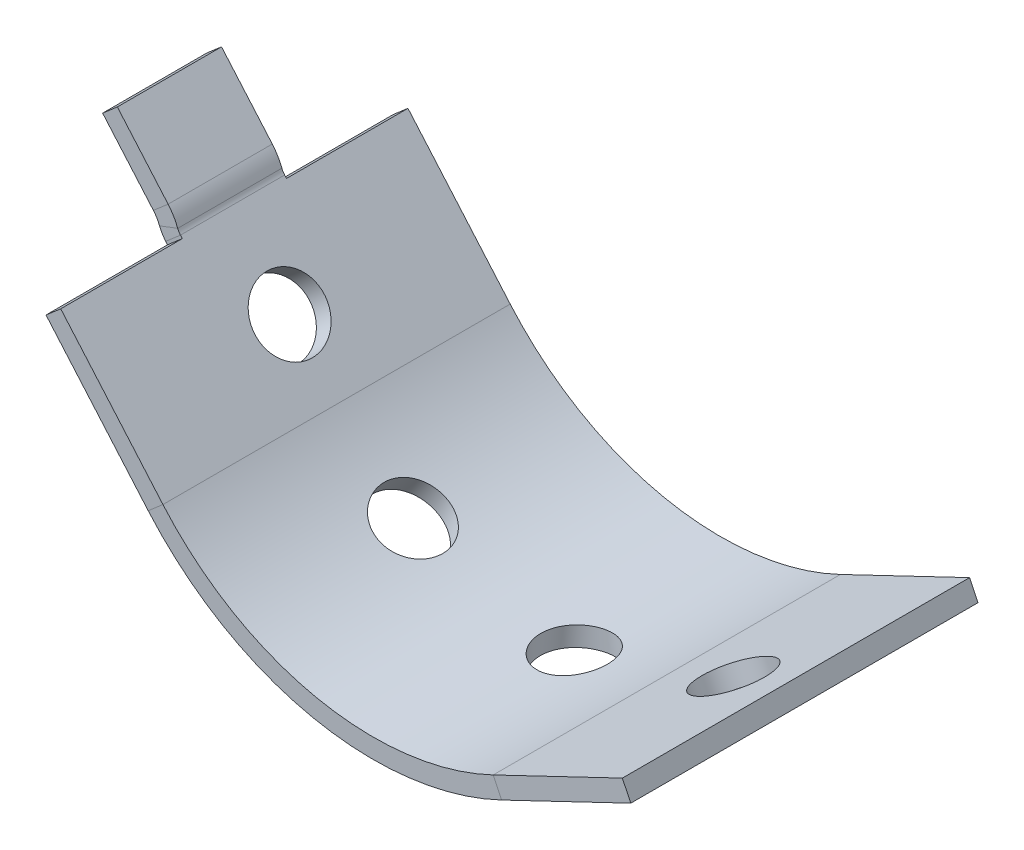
ISO-10303-21;
HEADER;
FILE_DESCRIPTION(('STEP AP214'),'2;1');
FILE_NAME('part.step','',(''),(''),'','','');
FILE_SCHEMA(('AUTOMOTIVE_DESIGN { 1 0 10303 214 1 1 1 1 }'));
ENDSEC;
DATA;
#1=APPLICATION_CONTEXT('core data for automotive mechanical design processes');
#2=APPLICATION_PROTOCOL_DEFINITION('international standard','automotive_design',2000,#1);
#3=PRODUCT_CONTEXT('',#1,'mechanical');
#4=PRODUCT('Part','Part','',(#3));
#5=PRODUCT_RELATED_PRODUCT_CATEGORY('part','',(#4));
#6=PRODUCT_DEFINITION_FORMATION('','',#4);
#7=PRODUCT_DEFINITION_CONTEXT('part definition',#1,'design');
#8=PRODUCT_DEFINITION('design','',#6,#7);
#9=PRODUCT_DEFINITION_SHAPE('','',#8);
#10=(LENGTH_UNIT() NAMED_UNIT(*) SI_UNIT(.MILLI.,.METRE.));
#11=(NAMED_UNIT(*) PLANE_ANGLE_UNIT() SI_UNIT($,.RADIAN.));
#12=(NAMED_UNIT(*) SI_UNIT($,.STERADIAN.) SOLID_ANGLE_UNIT());
#13=UNCERTAINTY_MEASURE_WITH_UNIT(LENGTH_MEASURE(1.E-05),#10,'distance_accuracy_value','');
#14=(GEOMETRIC_REPRESENTATION_CONTEXT(3) GLOBAL_UNCERTAINTY_ASSIGNED_CONTEXT((#13)) GLOBAL_UNIT_ASSIGNED_CONTEXT((#10,
#11,#12)) REPRESENTATION_CONTEXT('',''));
#15=CARTESIAN_POINT('',(0.,0.,0.));
#16=DIRECTION('',(0.,0.,1.));
#17=DIRECTION('',(1.,0.,0.));
#18=AXIS2_PLACEMENT_3D('',#15,#16,#17);
#19=CARTESIAN_POINT('',(89.0197499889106,-373.844889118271,7.5));
#20=DIRECTION('',(0.653423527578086,-0.756992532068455,0.));
#21=DIRECTION('',(0.756992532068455,0.653423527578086,0.));
#22=AXIS2_PLACEMENT_3D('',#19,#20,#21);
#23=PLANE('',#22);
#24=DIRECTION('',(0.756992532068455,0.653423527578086,0.));
#25=VECTOR('',#24,1.);
#26=CARTESIAN_POINT('',(89.0197499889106,-373.844889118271,7.5));
#27=LINE('',#26,#25);
#28=CARTESIAN_POINT('',(115.231401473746,-351.219421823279,7.5));
#29=VERTEX_POINT('',#28);
#30=CARTESIAN_POINT('',(117.350980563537,-349.38983594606,7.5));
#31=VERTEX_POINT('',#30);
#32=EDGE_CURVE('E443',#29,#31,#27,.T.);
#33=ORIENTED_EDGE('',*,*,#32,.T.);
#34=DIRECTION('',(0.,0.,-1.));
#35=VECTOR('',#34,1.);
#36=CARTESIAN_POINT('',(117.350980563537,-349.38983594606,7.5));
#37=LINE('',#36,#35);
#38=CARTESIAN_POINT('',(117.350980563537,-349.38983594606,-7.5));
#39=VERTEX_POINT('',#38);
#40=EDGE_CURVE('E441',#31,#39,#37,.T.);
#41=ORIENTED_EDGE('',*,*,#40,.T.);
#42=DIRECTION('',(0.756992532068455,0.653423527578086,0.));
#43=VECTOR('',#42,1.);
#44=CARTESIAN_POINT('',(89.0197499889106,-373.844889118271,-7.5));
#45=LINE('',#44,#43);
#46=CARTESIAN_POINT('',(115.231401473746,-351.219421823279,-7.5));
#47=VERTEX_POINT('',#46);
#48=EDGE_CURVE('E73',#47,#39,#45,.T.);
#49=ORIENTED_EDGE('',*,*,#48,.F.);
#50=DIRECTION('',(0.,0.,-1.));
#51=VECTOR('',#50,1.);
#52=CARTESIAN_POINT('',(115.231401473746,-351.219421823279,7.5));
#53=LINE('',#52,#51);
#54=EDGE_CURVE('E11',#29,#47,#53,.T.);
#55=ORIENTED_EDGE('',*,*,#54,.F.);
#56=EDGE_LOOP('',(#33,#41,#49,#55));
#57=FACE_BOUND('',#56,.T.);
#58=ADVANCED_FACE('F35',(#57),#23,.F.);
#59=CARTESIAN_POINT('',(96.3304194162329,-382.314315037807,7.5));
#60=DIRECTION('',(0.,0.,-1.));
#61=DIRECTION('',(-1.,0.,0.));
#62=AXIS2_PLACEMENT_3D('',#59,#60,#61);
#63=PLANE('',#62);
#64=DIRECTION('',(0.756992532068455,0.653423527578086,0.));
#65=VECTOR('',#64,1.);
#66=CARTESIAN_POINT('',(96.3304194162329,-382.314315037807,7.5));
#67=LINE('',#66,#65);
#68=CARTESIAN_POINT('',(122.542070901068,-359.688847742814,7.50000000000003));
#69=VERTEX_POINT('',#68);
#70=CARTESIAN_POINT('',(124.66164999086,-357.859261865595,7.50000000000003));
#71=VERTEX_POINT('',#70);
#72=EDGE_CURVE('E438',#69,#71,#67,.T.);
#73=ORIENTED_EDGE('',*,*,#72,.T.);
#74=DIRECTION('',(-0.653423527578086,0.756992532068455,0.));
#75=VECTOR('',#74,1.);
#76=CARTESIAN_POINT('',(124.66164999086,-357.859261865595,7.5));
#77=LINE('',#76,#75);
#78=EDGE_CURVE('E435',#71,#31,#77,.T.);
#79=ORIENTED_EDGE('',*,*,#78,.T.);
#80=ORIENTED_EDGE('',*,*,#32,.F.);
#81=DIRECTION('',(-0.653423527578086,0.756992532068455,0.));
#82=VECTOR('',#81,1.);
#83=CARTESIAN_POINT('',(122.542070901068,-359.688847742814,7.5));
#84=LINE('',#83,#82);
#85=EDGE_CURVE('E45',#69,#29,#84,.T.);
#86=ORIENTED_EDGE('',*,*,#85,.F.);
#87=EDGE_LOOP('',(#73,#79,#80,#86));
#88=FACE_BOUND('',#87,.T.);
#89=ADVANCED_FACE('F459',(#88),#63,.F.);
#90=CARTESIAN_POINT('',(124.66164999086,-357.859261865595,7.5));
#91=DIRECTION('',(-0.756992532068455,-0.653423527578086,0.));
#92=DIRECTION('',(0.653423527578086,-0.756992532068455,0.));
#93=AXIS2_PLACEMENT_3D('',#90,#91,#92);
#94=PLANE('',#93);
#95=DIRECTION('',(-0.653423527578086,0.756992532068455,0.));
#96=VECTOR('',#95,1.);
#97=CARTESIAN_POINT('',(124.66164999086,-357.859261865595,-7.5));
#98=LINE('',#97,#96);
#99=CARTESIAN_POINT('',(124.66164999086,-357.859261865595,-7.5));
#100=VERTEX_POINT('',#99);
#101=EDGE_CURVE('E433',#100,#39,#98,.T.);
#102=ORIENTED_EDGE('',*,*,#101,.T.);
#103=ORIENTED_EDGE('',*,*,#40,.F.);
#104=ORIENTED_EDGE('',*,*,#78,.F.);
#105=DIRECTION('',(0.,0.,-1.));
#106=VECTOR('',#105,1.);
#107=CARTESIAN_POINT('',(124.66164999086,-357.859261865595,7.5));
#108=LINE('',#107,#106);
#109=EDGE_CURVE('E196',#71,#100,#108,.T.);
#110=ORIENTED_EDGE('',*,*,#109,.T.);
#111=EDGE_LOOP('',(#102,#103,#104,#110));
#112=FACE_BOUND('',#111,.T.);
#113=ADVANCED_FACE('F461',(#112),#94,.F.);
#114=CARTESIAN_POINT('',(96.3304194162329,-382.314315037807,-7.5));
#115=DIRECTION('',(0.,0.,-1.));
#116=DIRECTION('',(-1.,0.,0.));
#117=AXIS2_PLACEMENT_3D('',#114,#115,#116);
#118=PLANE('',#117);
#119=ORIENTED_EDGE('',*,*,#101,.F.);
#120=DIRECTION('',(0.756992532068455,0.653423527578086,0.));
#121=VECTOR('',#120,1.);
#122=CARTESIAN_POINT('',(96.3304194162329,-382.314315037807,-7.5));
#123=LINE('',#122,#121);
#124=CARTESIAN_POINT('',(122.542070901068,-359.688847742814,-7.49999999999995));
#125=VERTEX_POINT('',#124);
#126=EDGE_CURVE('E444',#125,#100,#123,.T.);
#127=ORIENTED_EDGE('',*,*,#126,.F.);
#128=DIRECTION('',(-0.653423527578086,0.756992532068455,0.));
#129=VECTOR('',#128,1.);
#130=CARTESIAN_POINT('',(122.542070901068,-359.688847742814,-7.5));
#131=LINE('',#130,#129);
#132=EDGE_CURVE('E430',#125,#47,#131,.T.);
#133=ORIENTED_EDGE('',*,*,#132,.T.);
#134=ORIENTED_EDGE('',*,*,#48,.T.);
#135=EDGE_LOOP('',(#119,#127,#133,#134));
#136=FACE_BOUND('',#135,.T.);
#137=ADVANCED_FACE('F457',(#136),#118,.T.);
#138=CARTESIAN_POINT('',(122.542070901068,-359.688847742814,7.5));
#139=DIRECTION('',(-0.756992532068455,-0.653423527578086,0.));
#140=DIRECTION('',(0.653423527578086,-0.756992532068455,0.));
#141=AXIS2_PLACEMENT_3D('',#138,#139,#140);
#142=PLANE('',#141);
#143=ORIENTED_EDGE('',*,*,#132,.F.);
#144=DIRECTION('',(0.,0.,-1.));
#145=VECTOR('',#144,1.);
#146=CARTESIAN_POINT('',(122.542070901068,-359.688847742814,7.5));
#147=LINE('',#146,#145);
#148=EDGE_CURVE('E39',#69,#125,#147,.T.);
#149=ORIENTED_EDGE('',*,*,#148,.F.);
#150=ORIENTED_EDGE('',*,*,#85,.T.);
#151=ORIENTED_EDGE('',*,*,#54,.T.);
#152=EDGE_LOOP('',(#143,#149,#150,#151));
#153=FACE_BOUND('',#152,.T.);
#154=ADVANCED_FACE('F37',(#153),#142,.T.);
#155=CARTESIAN_POINT('',(198.548663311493,-383.541094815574,0.));
#156=DIRECTION('',(-0.431873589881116,0.901934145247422,0.));
#157=DIRECTION('',(-0.901934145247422,-0.431873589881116,0.));
#158=AXIS2_PLACEMENT_3D('',#155,#156,#157);
#159=CYLINDRICAL_SURFACE('',#158,5.00000000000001);
#160=CARTESIAN_POINT('',(199.75790936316,-386.066510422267,0.));
#161=DIRECTION('',(0.431873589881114,-0.901934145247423,0.));
#162=DIRECTION('',(0.901934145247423,0.431873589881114,0.));
#163=AXIS2_PLACEMENT_3D('',#160,#161,#162);
#164=CIRCLE('',#163,5.00000000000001);
#165=CARTESIAN_POINT('',(204.267580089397,-383.907142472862,0.));
#166=VERTEX_POINT('',#165);
#167=EDGE_CURVE('E419',#166,#166,#164,.T.);
#168=ORIENTED_EDGE('',*,*,#167,.T.);
#169=EDGE_LOOP('',(#168));
#170=FACE_BOUND('',#169,.T.);
#171=CARTESIAN_POINT('',(198.548663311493,-383.541094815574,0.));
#172=DIRECTION('',(-0.431873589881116,0.901934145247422,0.));
#173=DIRECTION('',(-0.901934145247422,-0.431873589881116,0.));
#174=AXIS2_PLACEMENT_3D('',#171,#172,#173);
#175=CIRCLE('',#174,5.00000000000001);
#176=CARTESIAN_POINT('',(194.038992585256,-385.700462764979,0.));
#177=VERTEX_POINT('',#176);
#178=EDGE_CURVE('E599',#177,#177,#175,.T.);
#179=ORIENTED_EDGE('',*,*,#178,.T.);
#180=EDGE_LOOP('',(#179));
#181=FACE_BOUND('',#180,.T.);
#182=ADVANCED_FACE('F494',(#170,#181),#159,.F.);
#183=CARTESIAN_POINT('',(160.852332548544,-281.660338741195,25.));
#184=DIRECTION('',(-0.901934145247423,-0.431873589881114,0.));
#185=DIRECTION('',(0.431873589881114,-0.901934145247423,0.));
#186=AXIS2_PLACEMENT_3D('',#183,#184,#185);
#187=PLANE('',#186);
#188=DIRECTION('',(0.,0.,-1.));
#189=VECTOR('',#188,1.);
#190=CARTESIAN_POINT('',(208.777250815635,-381.747774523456,25.));
#191=LINE('',#190,#189);
#192=CARTESIAN_POINT('',(208.777250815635,-381.747774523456,25.));
#193=VERTEX_POINT('',#192);
#194=CARTESIAN_POINT('',(208.777250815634,-381.747774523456,-25.));
#195=VERTEX_POINT('',#194);
#196=EDGE_CURVE('E597',#193,#195,#191,.T.);
#197=ORIENTED_EDGE('',*,*,#196,.T.);
#198=DIRECTION('',(0.431873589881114,-0.901934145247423,0.));
#199=VECTOR('',#198,1.);
#200=CARTESIAN_POINT('',(160.852332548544,-281.660338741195,-25.));
#201=LINE('',#200,#199);
#202=CARTESIAN_POINT('',(207.568004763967,-379.222358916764,-25.));
#203=VERTEX_POINT('',#202);
#204=EDGE_CURVE('E611',#203,#195,#201,.T.);
#205=ORIENTED_EDGE('',*,*,#204,.F.);
#206=DIRECTION('',(0.,0.,-1.));
#207=VECTOR('',#206,1.);
#208=CARTESIAN_POINT('',(207.568004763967,-379.222358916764,25.));
#209=LINE('',#208,#207);
#210=CARTESIAN_POINT('',(207.568004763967,-379.222358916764,25.));
#211=VERTEX_POINT('',#210);
#212=EDGE_CURVE('E425',#211,#203,#209,.T.);
#213=ORIENTED_EDGE('',*,*,#212,.F.);
#214=DIRECTION('',(0.431873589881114,-0.901934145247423,0.));
#215=VECTOR('',#214,1.);
#216=CARTESIAN_POINT('',(160.852332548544,-281.660338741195,25.));
#217=LINE('',#216,#215);
#218=EDGE_CURVE('E582',#211,#193,#217,.T.);
#219=ORIENTED_EDGE('',*,*,#218,.T.);
#220=EDGE_LOOP('',(#197,#205,#213,#219));
#221=FACE_BOUND('',#220,.T.);
#222=ADVANCED_FACE('F490',(#221),#187,.F.);
#223=CARTESIAN_POINT('',(160.852332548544,-281.660338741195,25.));
#224=DIRECTION('',(0.,0.,1.));
#225=DIRECTION('',(0.262419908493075,0.96495377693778,0.));
#226=AXIS2_PLACEMENT_3D('',#223,#224,#225);
#227=PLANE('',#226);
#228=DIRECTION('',(0.431873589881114,-0.901934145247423,0.));
#229=VECTOR('',#228,1.);
#230=CARTESIAN_POINT('',(142.254646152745,-290.565478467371,25.));
#231=LINE('',#230,#229);
#232=CARTESIAN_POINT('',(188.970318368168,-388.127498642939,25.));
#233=VERTEX_POINT('',#232);
#234=CARTESIAN_POINT('',(190.179564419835,-390.652914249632,25.));
#235=VERTEX_POINT('',#234);
#236=EDGE_CURVE('E576',#233,#235,#231,.T.);
#237=ORIENTED_EDGE('',*,*,#236,.T.);
#238=DIRECTION('',(-0.901934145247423,-0.431873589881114,0.));
#239=VECTOR('',#238,1.);
#240=CARTESIAN_POINT('',(208.777250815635,-381.747774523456,25.));
#241=LINE('',#240,#239);
#242=EDGE_CURVE('E590',#193,#235,#241,.T.);
#243=ORIENTED_EDGE('',*,*,#242,.F.);
#244=ORIENTED_EDGE('',*,*,#218,.F.);
#245=DIRECTION('',(-0.901934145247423,-0.431873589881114,0.));
#246=VECTOR('',#245,1.);
#247=CARTESIAN_POINT('',(207.568004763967,-379.222358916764,25.));
#248=LINE('',#247,#246);
#249=EDGE_CURVE('E581',#211,#233,#248,.T.);
#250=ORIENTED_EDGE('',*,*,#249,.T.);
#251=EDGE_LOOP('',(#237,#243,#244,#250));
#252=FACE_BOUND('',#251,.T.);
#253=ADVANCED_FACE('F486',(#252),#227,.T.);
#254=CARTESIAN_POINT('',(208.777250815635,-381.747774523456,25.));
#255=DIRECTION('',(0.431873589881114,-0.901934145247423,0.));
#256=DIRECTION('',(0.901934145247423,0.431873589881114,0.));
#257=AXIS2_PLACEMENT_3D('',#254,#255,#256);
#258=PLANE('',#257);
#259=ORIENTED_EDGE('',*,*,#167,.F.);
#260=EDGE_LOOP('',(#259));
#261=FACE_BOUND('',#260,.T.);
#262=DIRECTION('',(-0.901934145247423,-0.431873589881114,0.));
#263=VECTOR('',#262,1.);
#264=CARTESIAN_POINT('',(208.777250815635,-381.747774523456,-25.));
#265=LINE('',#264,#263);
#266=CARTESIAN_POINT('',(190.179564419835,-390.652914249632,-25.));
#267=VERTEX_POINT('',#266);
#268=EDGE_CURVE('E609',#195,#267,#265,.T.);
#269=ORIENTED_EDGE('',*,*,#268,.F.);
#270=ORIENTED_EDGE('',*,*,#196,.F.);
#271=ORIENTED_EDGE('',*,*,#242,.T.);
#272=DIRECTION('',(0.,0.,-1.));
#273=VECTOR('',#272,1.);
#274=CARTESIAN_POINT('',(190.179564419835,-390.652914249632,25.));
#275=LINE('',#274,#273);
#276=EDGE_CURVE('E592',#235,#267,#275,.T.);
#277=ORIENTED_EDGE('',*,*,#276,.T.);
#278=EDGE_LOOP('',(#269,#270,#271,#277));
#279=FACE_BOUND('',#278,.T.);
#280=ADVANCED_FACE('F482',(#261,#279),#258,.T.);
#281=CARTESIAN_POINT('',(160.852332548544,-281.660338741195,-25.));
#282=DIRECTION('',(0.,0.,1.));
#283=DIRECTION('',(0.262419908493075,0.96495377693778,0.));
#284=AXIS2_PLACEMENT_3D('',#281,#282,#283);
#285=PLANE('',#284);
#286=ORIENTED_EDGE('',*,*,#268,.T.);
#287=DIRECTION('',(0.431873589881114,-0.901934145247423,0.));
#288=VECTOR('',#287,1.);
#289=CARTESIAN_POINT('',(142.254646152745,-290.565478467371,-25.));
#290=LINE('',#289,#288);
#291=CARTESIAN_POINT('',(188.970318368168,-388.127498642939,-25.));
#292=VERTEX_POINT('',#291);
#293=EDGE_CURVE('E411',#292,#267,#290,.T.);
#294=ORIENTED_EDGE('',*,*,#293,.F.);
#295=DIRECTION('',(-0.901934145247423,-0.431873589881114,0.));
#296=VECTOR('',#295,1.);
#297=CARTESIAN_POINT('',(207.568004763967,-379.222358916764,-25.));
#298=LINE('',#297,#296);
#299=EDGE_CURVE('E588',#203,#292,#298,.T.);
#300=ORIENTED_EDGE('',*,*,#299,.F.);
#301=ORIENTED_EDGE('',*,*,#204,.T.);
#302=EDGE_LOOP('',(#286,#294,#300,#301));
#303=FACE_BOUND('',#302,.T.);
#304=ADVANCED_FACE('F478',(#303),#285,.F.);
#305=CARTESIAN_POINT('',(207.568004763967,-379.222358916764,25.));
#306=DIRECTION('',(0.431873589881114,-0.901934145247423,0.));
#307=DIRECTION('',(0.901934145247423,0.431873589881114,0.));
#308=AXIS2_PLACEMENT_3D('',#305,#306,#307);
#309=PLANE('',#308);
#310=ORIENTED_EDGE('',*,*,#178,.F.);
#311=EDGE_LOOP('',(#310));
#312=FACE_BOUND('',#311,.T.);
#313=ORIENTED_EDGE('',*,*,#299,.T.);
#314=DIRECTION('',(0.,0.,-1.));
#315=VECTOR('',#314,1.);
#316=CARTESIAN_POINT('',(188.970318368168,-388.127498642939,25.));
#317=LINE('',#316,#315);
#318=EDGE_CURVE('E410',#233,#292,#317,.T.);
#319=ORIENTED_EDGE('',*,*,#318,.F.);
#320=ORIENTED_EDGE('',*,*,#249,.F.);
#321=ORIENTED_EDGE('',*,*,#212,.T.);
#322=EDGE_LOOP('',(#313,#319,#320,#321));
#323=FACE_BOUND('',#322,.T.);
#324=ADVANCED_FACE('F474',(#312,#323),#309,.F.);
#325=CARTESIAN_POINT('',(224.691698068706,-306.304576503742,-25.));
#326=DIRECTION('',(0.,0.,1.));
#327=DIRECTION('',(1.,0.,0.));
#328=AXIS2_PLACEMENT_3D('',#325,#326,#327);
#329=PLANE('',#328);
#330=DIRECTION('',(-0.653423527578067,0.756992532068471,0.));
#331=VECTOR('',#330,1.);
#332=CARTESIAN_POINT('',(139.296094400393,-380.016659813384,-25.));
#333=LINE('',#332,#331);
#334=CARTESIAN_POINT('',(139.296094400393,-380.016659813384,-25.));
#335=VERTEX_POINT('',#334);
#336=CARTESIAN_POINT('',(124.578558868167,-362.966363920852,-25.));
#337=VERTEX_POINT('',#336);
#338=EDGE_CURVE('E311',#335,#337,#333,.T.);
#339=ORIENTED_EDGE('',*,*,#338,.T.);
#340=DIRECTION('',(-0.756992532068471,-0.653423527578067,0.));
#341=VECTOR('',#340,1.);
#342=CARTESIAN_POINT('',(209.974162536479,-289.254280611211,-25.));
#343=LINE('',#342,#341);
#344=CARTESIAN_POINT('',(126.698137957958,-361.136778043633,-25.));
#345=VERTEX_POINT('',#344);
#346=EDGE_CURVE('E374',#345,#337,#343,.T.);
#347=ORIENTED_EDGE('',*,*,#346,.F.);
#348=DIRECTION('',(-0.653423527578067,0.756992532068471,0.));
#349=VECTOR('',#348,1.);
#350=CARTESIAN_POINT('',(141.415673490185,-378.187073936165,-25.));
#351=LINE('',#350,#349);
#352=CARTESIAN_POINT('',(141.415673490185,-378.187073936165,-25.));
#353=VERTEX_POINT('',#352);
#354=EDGE_CURVE('E331',#353,#345,#351,.T.);
#355=ORIENTED_EDGE('',*,*,#354,.F.);
#356=DIRECTION('',(-0.756992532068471,-0.653423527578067,0.));
#357=VECTOR('',#356,1.);
#358=CARTESIAN_POINT('',(224.691698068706,-306.304576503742,-25.));
#359=LINE('',#358,#357);
#360=EDGE_CURVE('E358',#353,#335,#359,.T.);
#361=ORIENTED_EDGE('',*,*,#360,.T.);
#362=EDGE_LOOP('',(#339,#347,#355,#361));
#363=FACE_BOUND('',#362,.T.);
#364=ADVANCED_FACE('F477',(#363),#329,.F.);
#365=CARTESIAN_POINT('',(209.974162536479,-289.254280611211,25.));
#366=DIRECTION('',(-0.653423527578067,0.756992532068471,0.));
#367=DIRECTION('',(-0.756992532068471,-0.653423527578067,0.));
#368=AXIS2_PLACEMENT_3D('',#365,#366,#367);
#369=PLANE('',#368);
#370=ORIENTED_EDGE('',*,*,#346,.T.);
#371=DIRECTION('',(0.,0.,-1.));
#372=VECTOR('',#371,1.);
#373=CARTESIAN_POINT('',(124.578558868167,-362.966363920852,25.));
#374=LINE('',#373,#372);
#375=CARTESIAN_POINT('',(124.578558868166,-362.966363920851,-7.5));
#376=VERTEX_POINT('',#375);
#377=EDGE_CURVE('E327',#376,#337,#374,.T.);
#378=ORIENTED_EDGE('',*,*,#377,.F.);
#379=DIRECTION('',(-0.756992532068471,-0.653423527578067,0.));
#380=VECTOR('',#379,1.);
#381=CARTESIAN_POINT('',(209.974162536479,-289.25428061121,-7.5));
#382=LINE('',#381,#380);
#383=CARTESIAN_POINT('',(126.698137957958,-361.136778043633,-7.5));
#384=VERTEX_POINT('',#383);
#385=EDGE_CURVE('E376',#384,#376,#382,.T.);
#386=ORIENTED_EDGE('',*,*,#385,.F.);
#387=DIRECTION('',(0.,0.,-1.));
#388=VECTOR('',#387,1.);
#389=CARTESIAN_POINT('',(126.698137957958,-361.136778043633,25.));
#390=LINE('',#389,#388);
#391=EDGE_CURVE('E336',#384,#345,#390,.T.);
#392=ORIENTED_EDGE('',*,*,#391,.T.);
#393=EDGE_LOOP('',(#370,#378,#386,#392));
#394=FACE_BOUND('',#393,.T.);
#395=ADVANCED_FACE('F406',(#394),#369,.T.);
#396=CARTESIAN_POINT('',(209.974162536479,-289.25428061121,-7.5));
#397=DIRECTION('',(0.,0.,1.));
#398=DIRECTION('',(1.,0.,0.));
#399=AXIS2_PLACEMENT_3D('',#396,#397,#398);
#400=PLANE('',#399);
#401=DIRECTION('',(-0.653423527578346,0.75699253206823,0.));
#402=VECTOR('',#401,1.);
#403=CARTESIAN_POINT('',(124.578558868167,-362.966363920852,-7.5));
#404=LINE('',#403,#402);
#405=CARTESIAN_POINT('',(124.317189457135,-362.663566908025,-7.50000000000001));
#406=VERTEX_POINT('',#405);
#407=EDGE_CURVE('E332',#376,#406,#404,.T.);
#408=ORIENTED_EDGE('',*,*,#407,.T.);
#409=DIRECTION('',(-0.756992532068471,-0.653423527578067,0.));
#410=VECTOR('',#409,1.);
#411=CARTESIAN_POINT('',(209.712793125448,-288.951483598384,-7.5));
#412=LINE('',#411,#410);
#413=CARTESIAN_POINT('',(126.436768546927,-360.833981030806,-7.50000000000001));
#414=VERTEX_POINT('',#413);
#415=EDGE_CURVE('E379',#414,#406,#412,.T.);
#416=ORIENTED_EDGE('',*,*,#415,.F.);
#417=DIRECTION('',(-0.653423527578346,0.75699253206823,0.));
#418=VECTOR('',#417,1.);
#419=CARTESIAN_POINT('',(126.698137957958,-361.136778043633,-7.5));
#420=LINE('',#419,#418);
#421=EDGE_CURVE('E339',#384,#414,#420,.T.);
#422=ORIENTED_EDGE('',*,*,#421,.F.);
#423=ORIENTED_EDGE('',*,*,#385,.T.);
#424=EDGE_LOOP('',(#408,#416,#422,#423));
#425=FACE_BOUND('',#424,.T.);
#426=ADVANCED_FACE('F400',(#425),#400,.F.);
#427=CARTESIAN_POINT('',(209.974162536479,-289.25428061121,7.5));
#428=DIRECTION('',(0.,0.,1.));
#429=DIRECTION('',(1.,0.,0.));
#430=AXIS2_PLACEMENT_3D('',#427,#428,#429);
#431=PLANE('',#430);
#432=DIRECTION('',(-0.756992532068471,-0.653423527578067,0.));
#433=VECTOR('',#432,1.);
#434=CARTESIAN_POINT('',(209.712793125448,-288.951483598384,7.5));
#435=LINE('',#434,#433);
#436=CARTESIAN_POINT('',(126.436768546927,-360.833981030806,7.50000000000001));
#437=VERTEX_POINT('',#436);
#438=CARTESIAN_POINT('',(124.317189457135,-362.663566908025,7.5));
#439=VERTEX_POINT('',#438);
#440=EDGE_CURVE('E174',#437,#439,#435,.T.);
#441=ORIENTED_EDGE('',*,*,#440,.T.);
#442=DIRECTION('',(-0.653423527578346,0.75699253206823,0.));
#443=VECTOR('',#442,1.);
#444=CARTESIAN_POINT('',(124.578558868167,-362.966363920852,7.5));
#445=LINE('',#444,#443);
#446=CARTESIAN_POINT('',(124.578558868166,-362.966363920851,7.5));
#447=VERTEX_POINT('',#446);
#448=EDGE_CURVE('E321',#447,#439,#445,.T.);
#449=ORIENTED_EDGE('',*,*,#448,.F.);
#450=DIRECTION('',(-0.756992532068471,-0.653423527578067,0.));
#451=VECTOR('',#450,1.);
#452=CARTESIAN_POINT('',(209.974162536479,-289.25428061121,7.5));
#453=LINE('',#452,#451);
#454=CARTESIAN_POINT('',(126.698137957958,-361.136778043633,7.5));
#455=VERTEX_POINT('',#454);
#456=EDGE_CURVE('E366',#455,#447,#453,.T.);
#457=ORIENTED_EDGE('',*,*,#456,.F.);
#458=DIRECTION('',(-0.653423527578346,0.75699253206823,0.));
#459=VECTOR('',#458,1.);
#460=CARTESIAN_POINT('',(126.698137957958,-361.136778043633,7.5));
#461=LINE('',#460,#459);
#462=EDGE_CURVE('E350',#455,#437,#461,.T.);
#463=ORIENTED_EDGE('',*,*,#462,.T.);
#464=EDGE_LOOP('',(#441,#449,#457,#463));
#465=FACE_BOUND('',#464,.T.);
#466=ADVANCED_FACE('F388',(#465),#431,.T.);
#467=ORIENTED_EDGE('',*,*,#456,.T.);
#468=CARTESIAN_POINT('',(124.578558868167,-362.966363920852,25.));
#469=VERTEX_POINT('',#468);
#470=EDGE_CURVE('E318',#469,#447,#374,.T.);
#471=ORIENTED_EDGE('',*,*,#470,.F.);
#472=DIRECTION('',(-0.756992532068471,-0.653423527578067,0.));
#473=VECTOR('',#472,1.);
#474=CARTESIAN_POINT('',(209.974162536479,-289.254280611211,25.));
#475=LINE('',#474,#473);
#476=CARTESIAN_POINT('',(126.698137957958,-361.136778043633,25.));
#477=VERTEX_POINT('',#476);
#478=EDGE_CURVE('E363',#477,#469,#475,.T.);
#479=ORIENTED_EDGE('',*,*,#478,.F.);
#480=EDGE_CURVE('E345',#477,#455,#390,.T.);
#481=ORIENTED_EDGE('',*,*,#480,.T.);
#482=EDGE_LOOP('',(#467,#471,#479,#481));
#483=FACE_BOUND('',#482,.T.);
#484=ADVANCED_FACE('F505',(#483),#369,.T.);
#485=CARTESIAN_POINT('',(224.691698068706,-306.304576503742,25.));
#486=DIRECTION('',(0.,0.,1.));
#487=DIRECTION('',(1.,0.,0.));
#488=AXIS2_PLACEMENT_3D('',#485,#486,#487);
#489=PLANE('',#488);
#490=ORIENTED_EDGE('',*,*,#478,.T.);
#491=DIRECTION('',(-0.653423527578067,0.756992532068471,0.));
#492=VECTOR('',#491,1.);
#493=CARTESIAN_POINT('',(139.296094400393,-380.016659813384,25.));
#494=LINE('',#493,#492);
#495=CARTESIAN_POINT('',(139.296094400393,-380.016659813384,25.));
#496=VERTEX_POINT('',#495);
#497=EDGE_CURVE('E315',#496,#469,#494,.T.);
#498=ORIENTED_EDGE('',*,*,#497,.F.);
#499=DIRECTION('',(-0.756992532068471,-0.653423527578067,0.));
#500=VECTOR('',#499,1.);
#501=CARTESIAN_POINT('',(224.691698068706,-306.304576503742,25.));
#502=LINE('',#501,#500);
#503=CARTESIAN_POINT('',(141.415673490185,-378.187073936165,25.));
#504=VERTEX_POINT('',#503);
#505=EDGE_CURVE('E361',#504,#496,#502,.T.);
#506=ORIENTED_EDGE('',*,*,#505,.F.);
#507=DIRECTION('',(-0.653423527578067,0.756992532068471,0.));
#508=VECTOR('',#507,1.);
#509=CARTESIAN_POINT('',(141.415673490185,-378.187073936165,25.));
#510=LINE('',#509,#508);
#511=EDGE_CURVE('E349',#504,#477,#510,.T.);
#512=ORIENTED_EDGE('',*,*,#511,.T.);
#513=EDGE_LOOP('',(#490,#498,#506,#512));
#514=FACE_BOUND('',#513,.T.);
#515=ADVANCED_FACE('F508',(#514),#489,.T.);
#516=CARTESIAN_POINT('',(141.415673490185,-378.187073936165,25.));
#517=DIRECTION('',(-0.756992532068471,-0.653423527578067,0.));
#518=DIRECTION('',(0.653423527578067,-0.756992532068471,0.));
#519=AXIS2_PLACEMENT_3D('',#516,#517,#518);
#520=PLANE('',#519);
#521=CARTESIAN_POINT('',(134.657865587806,-370.358139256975,0.));
#522=DIRECTION('',(0.75699253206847,0.653423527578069,0.));
#523=DIRECTION('',(-0.653423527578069,0.75699253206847,0.));
#524=AXIS2_PLACEMENT_3D('',#521,#522,#523);
#525=CIRCLE('',#524,5.00000000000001);
#526=CARTESIAN_POINT('',(131.390747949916,-366.573176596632,0.));
#527=VERTEX_POINT('',#526);
#528=EDGE_CURVE('E302',#527,#527,#525,.T.);
#529=ORIENTED_EDGE('',*,*,#528,.F.);
#530=EDGE_LOOP('',(#529));
#531=FACE_BOUND('',#530,.T.);
#532=ORIENTED_EDGE('',*,*,#354,.T.);
#533=ORIENTED_EDGE('',*,*,#391,.F.);
#534=ORIENTED_EDGE('',*,*,#421,.T.);
#535=DIRECTION('',(0.,0.,-1.));
#536=VECTOR('',#535,1.);
#537=CARTESIAN_POINT('',(126.436768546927,-360.833981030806,7.5));
#538=LINE('',#537,#536);
#539=EDGE_CURVE('E622',#437,#414,#538,.T.);
#540=ORIENTED_EDGE('',*,*,#539,.F.);
#541=ORIENTED_EDGE('',*,*,#462,.F.);
#542=ORIENTED_EDGE('',*,*,#480,.F.);
#543=ORIENTED_EDGE('',*,*,#511,.F.);
#544=DIRECTION('',(0.,0.,-1.));
#545=VECTOR('',#544,1.);
#546=CARTESIAN_POINT('',(141.415673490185,-378.187073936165,25.));
#547=LINE('',#546,#545);
#548=EDGE_CURVE('E355',#504,#353,#547,.T.);
#549=ORIENTED_EDGE('',*,*,#548,.T.);
#550=EDGE_LOOP('',(#532,#533,#534,#540,#541,#542,#543,#549));
#551=FACE_BOUND('',#550,.T.);
#552=ADVANCED_FACE('F511',(#531,#551),#520,.F.);
#553=CARTESIAN_POINT('',(139.296094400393,-380.016659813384,25.));
#554=DIRECTION('',(-0.756992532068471,-0.653423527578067,0.));
#555=DIRECTION('',(0.653423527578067,-0.756992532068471,0.));
#556=AXIS2_PLACEMENT_3D('',#553,#554,#555);
#557=PLANE('',#556);
#558=CARTESIAN_POINT('',(132.538286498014,-372.187725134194,0.));
#559=DIRECTION('',(-0.756992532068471,-0.653423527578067,0.));
#560=DIRECTION('',(0.653423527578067,-0.756992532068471,0.));
#561=AXIS2_PLACEMENT_3D('',#558,#559,#560);
#562=CIRCLE('',#561,5.00000000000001);
#563=CARTESIAN_POINT('',(135.805404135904,-375.972687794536,0.));
#564=VERTEX_POINT('',#563);
#565=EDGE_CURVE('E310',#564,#564,#562,.T.);
#566=ORIENTED_EDGE('',*,*,#565,.F.);
#567=EDGE_LOOP('',(#566));
#568=FACE_BOUND('',#567,.T.);
#569=ORIENTED_EDGE('',*,*,#338,.F.);
#570=DIRECTION('',(0.,0.,-1.));
#571=VECTOR('',#570,1.);
#572=CARTESIAN_POINT('',(139.296094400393,-380.016659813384,25.));
#573=LINE('',#572,#571);
#574=EDGE_CURVE('E313',#496,#335,#573,.T.);
#575=ORIENTED_EDGE('',*,*,#574,.F.);
#576=ORIENTED_EDGE('',*,*,#497,.T.);
#577=ORIENTED_EDGE('',*,*,#470,.T.);
#578=ORIENTED_EDGE('',*,*,#448,.T.);
#579=DIRECTION('',(0.,0.,-1.));
#580=VECTOR('',#579,1.);
#581=CARTESIAN_POINT('',(124.317189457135,-362.663566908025,7.5));
#582=LINE('',#581,#580);
#583=EDGE_CURVE('E395',#439,#406,#582,.T.);
#584=ORIENTED_EDGE('',*,*,#583,.T.);
#585=ORIENTED_EDGE('',*,*,#407,.F.);
#586=ORIENTED_EDGE('',*,*,#377,.T.);
#587=EDGE_LOOP('',(#569,#575,#576,#577,#578,#584,#585,#586));
#588=FACE_BOUND('',#587,.T.);
#589=ADVANCED_FACE('F393',(#568,#588),#557,.T.);
#590=CARTESIAN_POINT('',(134.657865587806,-370.358139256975,0.));
#591=DIRECTION('',(0.75699253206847,0.653423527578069,0.));
#592=DIRECTION('',(-0.653423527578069,0.75699253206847,0.));
#593=AXIS2_PLACEMENT_3D('',#590,#591,#592);
#594=CYLINDRICAL_SURFACE('',#593,5.00000000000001);
#595=ORIENTED_EDGE('',*,*,#565,.T.);
#596=EDGE_LOOP('',(#595));
#597=FACE_BOUND('',#596,.T.);
#598=ORIENTED_EDGE('',*,*,#528,.T.);
#599=EDGE_LOOP('',(#598));
#600=FACE_BOUND('',#599,.T.);
#601=ADVANCED_FACE('F291',(#597,#600),#594,.F.);
#602=CARTESIAN_POINT('',(171.695374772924,-352.050132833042,-25.));
#603=DIRECTION('',(0.,0.,-1.));
#604=DIRECTION('',(-1.,0.,0.));
#605=AXIS2_PLACEMENT_3D('',#602,#603,#604);
#606=PLANE('',#605);
#607=ORIENTED_EDGE('',*,*,#360,.F.);
#608=CARTESIAN_POINT('',(171.695374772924,-352.050132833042,-25.));
#609=DIRECTION('',(0.,0.,-1.));
#610=DIRECTION('',(-1.,0.,0.));
#611=AXIS2_PLACEMENT_3D('',#608,#609,#610);
#612=CIRCLE('',#611,39.9999999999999);
#613=EDGE_CURVE('E531',#353,#292,#612,.F.);
#614=ORIENTED_EDGE('',*,*,#613,.T.);
#615=ORIENTED_EDGE('',*,*,#293,.T.);
#616=CARTESIAN_POINT('',(171.695374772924,-352.050132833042,-25.));
#617=DIRECTION('',(0.,0.,-1.));
#618=DIRECTION('',(-1.,0.,0.));
#619=AXIS2_PLACEMENT_3D('',#616,#617,#618);
#620=CIRCLE('',#619,42.7999999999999);
#621=EDGE_CURVE('E240',#335,#267,#620,.F.);
#622=ORIENTED_EDGE('',*,*,#621,.F.);
#623=EDGE_LOOP('',(#607,#614,#615,#622));
#624=FACE_BOUND('',#623,.T.);
#625=ADVANCED_FACE('F289',(#624),#606,.T.);
#626=CARTESIAN_POINT('',(171.695374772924,-352.050132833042,25.));
#627=DIRECTION('',(0.,0.,1.));
#628=DIRECTION('',(1.,0.,0.));
#629=AXIS2_PLACEMENT_3D('',#626,#627,#628);
#630=PLANE('',#629);
#631=ORIENTED_EDGE('',*,*,#236,.F.);
#632=CARTESIAN_POINT('',(171.695374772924,-352.050132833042,25.));
#633=DIRECTION('',(0.,0.,-1.));
#634=DIRECTION('',(-1.,0.,0.));
#635=AXIS2_PLACEMENT_3D('',#632,#633,#634);
#636=CIRCLE('',#635,39.9999999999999);
#637=EDGE_CURVE('E209',#233,#504,#636,.T.);
#638=ORIENTED_EDGE('',*,*,#637,.T.);
#639=ORIENTED_EDGE('',*,*,#505,.T.);
#640=CARTESIAN_POINT('',(171.695374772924,-352.050132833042,25.));
#641=DIRECTION('',(0.,0.,-1.));
#642=DIRECTION('',(-1.,0.,0.));
#643=AXIS2_PLACEMENT_3D('',#640,#641,#642);
#644=CIRCLE('',#643,42.7999999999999);
#645=EDGE_CURVE('E215',#235,#496,#644,.T.);
#646=ORIENTED_EDGE('',*,*,#645,.F.);
#647=EDGE_LOOP('',(#631,#638,#639,#646));
#648=FACE_BOUND('',#647,.T.);
#649=ADVANCED_FACE('F231',(#648),#630,.T.);
#650=CARTESIAN_POINT('',(146.638744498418,-386.748912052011,0.));
#651=CARTESIAN_POINT('',(146.63886587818,-386.748999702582,0.657235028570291));
#652=CARTESIAN_POINT('',(146.746848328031,-386.82768997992,1.30687880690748));
#653=CARTESIAN_POINT('',(147.170741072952,-387.127900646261,2.51995431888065));
#654=CARTESIAN_POINT('',(147.48279369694,-387.346326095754,3.07128350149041));
#655=CARTESIAN_POINT('',(148.280371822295,-387.880399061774,3.99978273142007));
#656=CARTESIAN_POINT('',(148.758609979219,-388.190664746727,4.36814247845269));
#657=CARTESIAN_POINT('',(149.827242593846,-388.847116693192,4.87065215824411));
#658=CARTESIAN_POINT('',(150.407615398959,-389.186799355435,4.9999937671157));
#659=CARTESIAN_POINT('',(151.595895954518,-389.843143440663,5.00000619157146));
#660=CARTESIAN_POINT('',(152.192444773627,-390.15353101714,4.87063996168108));
#661=CARTESIAN_POINT('',(153.317116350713,-390.708545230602,4.36815433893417));
#662=CARTESIAN_POINT('',(153.834374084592,-390.948140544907,3.99977165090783));
#663=CARTESIAN_POINT('',(154.711138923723,-391.338885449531,3.07129389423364));
#664=CARTESIAN_POINT('',(155.062175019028,-391.48671633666,2.51988198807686));
#665=CARTESIAN_POINT('',(155.541995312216,-391.685669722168,1.30695018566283));
#666=CARTESIAN_POINT('',(155.666169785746,-391.735200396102,0.656145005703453));
#667=CARTESIAN_POINT('',(155.666308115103,-391.735256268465,-0.656146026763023));
#668=CARTESIAN_POINT('',(155.541998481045,-391.68567103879,-1.30687369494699));
#669=CARTESIAN_POINT('',(155.062171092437,-391.486714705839,-2.51996036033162));
#670=CARTESIAN_POINT('',(154.711133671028,-391.338883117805,-3.07128118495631));
#671=CARTESIAN_POINT('',(153.834377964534,-390.948142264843,-3.99978579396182));
#672=CARTESIAN_POINT('',(153.317108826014,-390.708541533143,-4.36814385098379));
#673=CARTESIAN_POINT('',(152.192450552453,-390.153533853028,-4.87065123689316));
#674=CARTESIAN_POINT('',(151.595888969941,-389.843139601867,-4.99999318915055));
#675=CARTESIAN_POINT('',(150.407620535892,-389.186802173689,-5.0000067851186));
#676=CARTESIAN_POINT('',(149.827243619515,-388.847117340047,-4.87063845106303));
#677=CARTESIAN_POINT('',(148.75860728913,-388.190663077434,-4.36815541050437));
#678=CARTESIAN_POINT('',(148.280381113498,-387.880405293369,-3.99977500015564));
#679=CARTESIAN_POINT('',(147.482783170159,-387.346319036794,-3.071289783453));
#680=CARTESIAN_POINT('',(147.170741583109,-387.127901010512,-2.51988748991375));
#681=CARTESIAN_POINT('',(146.746847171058,-386.827689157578,-1.3069437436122));
#682=CARTESIAN_POINT('',(146.638623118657,-386.74882440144,-0.657235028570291));
#683=CARTESIAN_POINT('',(146.638744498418,-386.748912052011,0.));
#684=CARTESIAN_POINT('',(148.277963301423,-384.478898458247,0.));
#685=CARTESIAN_POINT('',(148.278076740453,-384.478980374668,0.657235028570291));
#686=CARTESIAN_POINT('',(148.378994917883,-384.552522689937,1.30687880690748));
#687=CARTESIAN_POINT('',(148.775156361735,-384.833093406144,2.51995431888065));
#688=CARTESIAN_POINT('',(149.066794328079,-385.037229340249,3.07128350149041));
#689=CARTESIAN_POINT('',(149.812194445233,-385.536362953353,3.99978273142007));
#690=CARTESIAN_POINT('',(150.25914599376,-385.826330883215,4.36814247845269));
#691=CARTESIAN_POINT('',(151.257868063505,-386.439837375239,4.87065215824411));
#692=CARTESIAN_POINT('',(151.800272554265,-386.757297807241,4.9999937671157));
#693=CARTESIAN_POINT('',(152.910815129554,-387.37070349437,5.00000619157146));
#694=CARTESIAN_POINT('',(153.468337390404,-387.660785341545,4.87063996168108));
#695=CARTESIAN_POINT('',(154.519432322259,-388.179490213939,4.36815433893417));
#696=CARTESIAN_POINT('',(155.002850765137,-388.40341106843,3.99977165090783));
#697=CARTESIAN_POINT('',(155.822257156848,-388.768593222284,3.07129389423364));
#698=CARTESIAN_POINT('',(156.150328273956,-388.906752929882,2.51988198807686));
#699=CARTESIAN_POINT('',(156.598758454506,-389.092690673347,1.30695018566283));
#700=CARTESIAN_POINT('',(156.714809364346,-389.138981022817,0.656145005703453));
#701=CARTESIAN_POINT('',(156.71493864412,-389.139033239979,-0.656146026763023));
#702=CARTESIAN_POINT('',(156.598761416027,-389.092691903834,-1.30687369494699));
#703=CARTESIAN_POINT('',(156.150324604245,-388.906751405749,-2.51996036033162));
#704=CARTESIAN_POINT('',(155.822252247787,-388.768591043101,-3.07128118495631));
#705=CARTESIAN_POINT('',(155.002854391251,-388.403412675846,-3.99978579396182));
#706=CARTESIAN_POINT('',(154.519425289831,-388.17948675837,-4.36814385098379));
#707=CARTESIAN_POINT('',(153.468342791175,-387.660787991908,-4.87065123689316));
#708=CARTESIAN_POINT('',(152.910808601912,-387.37069990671,-4.99999318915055));
#709=CARTESIAN_POINT('',(151.800277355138,-386.757300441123,-5.0000067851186));
#710=CARTESIAN_POINT('',(151.257869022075,-386.439837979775,-4.87063845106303));
#711=CARTESIAN_POINT('',(150.259143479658,-385.826329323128,-4.36815541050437));
#712=CARTESIAN_POINT('',(149.812203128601,-385.536368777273,-3.99977500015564));
#713=CARTESIAN_POINT('',(149.066784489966,-385.037222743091,-3.071289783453));
#714=CARTESIAN_POINT('',(148.775156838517,-384.833093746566,-2.51988748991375));
#715=CARTESIAN_POINT('',(148.378993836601,-384.552521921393,-1.3069437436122));
#716=CARTESIAN_POINT('',(148.277849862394,-384.478816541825,-0.657235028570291));
#717=CARTESIAN_POINT('',(148.277963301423,-384.478898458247,0.));
#718=B_SPLINE_SURFACE_WITH_KNOTS('',1,3,((#650,#651,#652,#653,#654,#655,#656,#657,#658,#659,
#660,#661,#662,#663,#664,#665,#666,#667,#668,#669,#670,#671,#672,#673,#674,#675,#676,#677,#678,
#679,#680,#681,#682,#683),(#684,#685,#686,#687,#688,#689,#690,#691,#692,#693,#694,#695,#696,
#697,#698,#699,#700,#701,#702,#703,#704,#705,#706,#707,#708,#709,#710,#711,#712,#713,#714,#715,
#716,#717)),.UNSPECIFIED.,.F.,.T.,.F.,(2,2),(4,2,2,2,2,2,2,2,2,2,2,2,2,2,2,2,4),(0.,1.),(0.,
0.0625,0.125,0.1875,0.25,0.3125,0.375,0.4375,0.5,0.5625,0.625,0.6875,0.75,0.8125,0.875,0.9375,
1.),.UNSPECIFIED.);
#719=CARTESIAN_POINT('',(146.638744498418,-386.748912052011,0.));
#720=CARTESIAN_POINT('',(146.638623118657,-386.74882440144,-0.657235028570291));
#721=CARTESIAN_POINT('',(146.746847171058,-386.827689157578,-1.3069437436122));
#722=CARTESIAN_POINT('',(147.170741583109,-387.127901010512,-2.51988748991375));
#723=CARTESIAN_POINT('',(147.482783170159,-387.346319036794,-3.071289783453));
#724=CARTESIAN_POINT('',(148.280381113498,-387.880405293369,-3.99977500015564));
#725=CARTESIAN_POINT('',(148.75860728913,-388.190663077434,-4.36815541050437));
#726=CARTESIAN_POINT('',(149.827243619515,-388.847117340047,-4.87063845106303));
#727=CARTESIAN_POINT('',(150.407620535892,-389.186802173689,-5.0000067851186));
#728=CARTESIAN_POINT('',(151.595888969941,-389.843139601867,-4.99999318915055));
#729=CARTESIAN_POINT('',(152.192450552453,-390.153533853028,-4.87065123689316));
#730=CARTESIAN_POINT('',(153.317108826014,-390.708541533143,-4.36814385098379));
#731=CARTESIAN_POINT('',(153.834377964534,-390.948142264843,-3.99978579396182));
#732=CARTESIAN_POINT('',(154.711133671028,-391.338883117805,-3.07128118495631));
#733=CARTESIAN_POINT('',(155.062171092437,-391.486714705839,-2.51996036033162));
#734=CARTESIAN_POINT('',(155.541998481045,-391.68567103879,-1.30687369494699));
#735=CARTESIAN_POINT('',(155.666308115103,-391.735256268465,-0.656146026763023));
#736=CARTESIAN_POINT('',(155.666169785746,-391.735200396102,0.656145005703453));
#737=CARTESIAN_POINT('',(155.541995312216,-391.685669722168,1.30695018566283));
#738=CARTESIAN_POINT('',(155.062175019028,-391.48671633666,2.51988198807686));
#739=CARTESIAN_POINT('',(154.711138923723,-391.338885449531,3.07129389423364));
#740=CARTESIAN_POINT('',(153.834374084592,-390.948140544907,3.99977165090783));
#741=CARTESIAN_POINT('',(153.317116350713,-390.708545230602,4.36815433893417));
#742=CARTESIAN_POINT('',(152.192444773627,-390.15353101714,4.87063996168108));
#743=CARTESIAN_POINT('',(151.595895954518,-389.843143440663,5.00000619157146));
#744=CARTESIAN_POINT('',(150.407615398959,-389.186799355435,4.9999937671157));
#745=CARTESIAN_POINT('',(149.827242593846,-388.847116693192,4.87065215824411));
#746=CARTESIAN_POINT('',(148.758609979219,-388.190664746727,4.36814247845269));
#747=CARTESIAN_POINT('',(148.280371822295,-387.880399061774,3.99978273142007));
#748=CARTESIAN_POINT('',(147.48279369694,-387.346326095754,3.07128350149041));
#749=CARTESIAN_POINT('',(147.170741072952,-387.127900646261,2.51995431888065));
#750=CARTESIAN_POINT('',(146.746848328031,-386.82768997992,1.30687880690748));
#751=CARTESIAN_POINT('',(146.63886587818,-386.748999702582,0.657235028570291));
#752=CARTESIAN_POINT('',(146.638744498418,-386.748912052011,0.));
#753=B_SPLINE_CURVE_WITH_KNOTS('',3,(#719,#720,#721,#722,#723,#724,#725,#726,#727,#728,#729,
#730,#731,#732,#733,#734,#735,#736,#737,#738,#739,#740,#741,#742,#743,#744,#745,#746,#747,#748,
#749,#750,#751,#752),.UNSPECIFIED.,.T.,.F.,(4,2,2,2,2,2,2,2,2,2,2,2,2,2,2,2,4),(0.,0.0625,0.125,
0.1875,0.25,0.3125,0.375,0.4375,0.5,0.5625,0.625,0.6875,0.75,0.8125,0.875,0.9375,1.),.UNSPECIFIED.);
#754=CARTESIAN_POINT('',(146.638744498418,-386.748912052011,0.));
#755=VERTEX_POINT('',#754);
#756=EDGE_CURVE('E538',#755,#755,#753,.F.);
#757=CARTESIAN_POINT('',(148.277963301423,-384.478898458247,0.));
#758=CARTESIAN_POINT('',(148.278076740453,-384.478980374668,0.657235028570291));
#759=CARTESIAN_POINT('',(148.378994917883,-384.552522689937,1.30687880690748));
#760=CARTESIAN_POINT('',(148.775156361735,-384.833093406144,2.51995431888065));
#761=CARTESIAN_POINT('',(149.066794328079,-385.037229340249,3.07128350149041));
#762=CARTESIAN_POINT('',(149.812194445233,-385.536362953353,3.99978273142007));
#763=CARTESIAN_POINT('',(150.25914599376,-385.826330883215,4.36814247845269));
#764=CARTESIAN_POINT('',(151.257868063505,-386.439837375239,4.87065215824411));
#765=CARTESIAN_POINT('',(151.800272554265,-386.757297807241,4.9999937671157));
#766=CARTESIAN_POINT('',(152.910815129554,-387.37070349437,5.00000619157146));
#767=CARTESIAN_POINT('',(153.468337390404,-387.660785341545,4.87063996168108));
#768=CARTESIAN_POINT('',(154.519432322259,-388.179490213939,4.36815433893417));
#769=CARTESIAN_POINT('',(155.002850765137,-388.40341106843,3.99977165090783));
#770=CARTESIAN_POINT('',(155.822257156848,-388.768593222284,3.07129389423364));
#771=CARTESIAN_POINT('',(156.150328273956,-388.906752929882,2.51988198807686));
#772=CARTESIAN_POINT('',(156.598758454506,-389.092690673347,1.30695018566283));
#773=CARTESIAN_POINT('',(156.714809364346,-389.138981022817,0.656145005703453));
#774=CARTESIAN_POINT('',(156.71493864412,-389.139033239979,-0.656146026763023));
#775=CARTESIAN_POINT('',(156.598761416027,-389.092691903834,-1.30687369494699));
#776=CARTESIAN_POINT('',(156.150324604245,-388.906751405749,-2.51996036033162));
#777=CARTESIAN_POINT('',(155.822252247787,-388.768591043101,-3.07128118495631));
#778=CARTESIAN_POINT('',(155.002854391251,-388.403412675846,-3.99978579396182));
#779=CARTESIAN_POINT('',(154.519425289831,-388.17948675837,-4.36814385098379));
#780=CARTESIAN_POINT('',(153.468342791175,-387.660787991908,-4.87065123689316));
#781=CARTESIAN_POINT('',(152.910808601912,-387.37069990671,-4.99999318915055));
#782=CARTESIAN_POINT('',(151.800277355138,-386.757300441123,-5.0000067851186));
#783=CARTESIAN_POINT('',(151.257869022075,-386.439837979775,-4.87063845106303));
#784=CARTESIAN_POINT('',(150.259143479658,-385.826329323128,-4.36815541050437));
#785=CARTESIAN_POINT('',(149.812203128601,-385.536368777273,-3.99977500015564));
#786=CARTESIAN_POINT('',(149.066784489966,-385.037222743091,-3.071289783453));
#787=CARTESIAN_POINT('',(148.775156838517,-384.833093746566,-2.51988748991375));
#788=CARTESIAN_POINT('',(148.378993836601,-384.552521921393,-1.3069437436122));
#789=CARTESIAN_POINT('',(148.277849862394,-384.478816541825,-0.657235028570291));
#790=CARTESIAN_POINT('',(148.277963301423,-384.478898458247,0.));
#791=B_SPLINE_CURVE_WITH_KNOTS('',3,(#757,#758,#759,#760,#761,#762,#763,#764,#765,#766,#767,
#768,#769,#770,#771,#772,#773,#774,#775,#776,#777,#778,#779,#780,#781,#782,#783,#784,#785,#786,
#787,#788,#789,#790),.UNSPECIFIED.,.T.,.F.,(4,2,2,2,2,2,2,2,2,2,2,2,2,2,2,2,4),(0.,0.0625,0.125,
0.1875,0.25,0.3125,0.375,0.4375,0.5,0.5625,0.625,0.6875,0.75,0.8125,0.875,0.9375,1.),.UNSPECIFIED.);
#792=CARTESIAN_POINT('',(148.277963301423,-384.478898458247,0.));
#793=VERTEX_POINT('',#792);
#794=EDGE_CURVE('E533',#793,#793,#791,.T.);
#795=ORIENTED_EDGE('',*,*,#756,.F.);
#796=EDGE_LOOP('',(#795));
#797=FACE_BOUND('',#796,.T.);
#798=ORIENTED_EDGE('',*,*,#794,.T.);
#799=EDGE_LOOP('',(#798));
#800=FACE_BOUND('',#799,.T.);
#801=ADVANCED_FACE('F288',(#797,#800),#718,.T.);
#802=CARTESIAN_POINT('',(170.773014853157,-394.840193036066,0.));
#803=CARTESIAN_POINT('',(170.773164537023,-394.840196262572,0.657235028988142));
#804=CARTESIAN_POINT('',(170.906732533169,-394.843654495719,1.30687880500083));
#805=CARTESIAN_POINT('',(171.426126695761,-394.850073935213,2.51995432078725));
#806=CARTESIAN_POINT('',(171.80702003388,-394.852678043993,3.07128350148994));
#807=CARTESIAN_POINT('',(172.766805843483,-394.839411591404,3.99978273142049));
#808=CARTESIAN_POINT('',(173.336643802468,-394.823248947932,4.36814247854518));
#809=CARTESIAN_POINT('',(174.589037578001,-394.756806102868,4.87065215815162));
#810=CARTESIAN_POINT('',(175.259651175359,-394.706863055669,4.9999937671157));
#811=CARTESIAN_POINT('',(176.610471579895,-394.572391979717,5.00000619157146));
#812=CARTESIAN_POINT('',(177.277765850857,-394.489149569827,4.87063996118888));
#813=CARTESIAN_POINT('',(178.518688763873,-394.307388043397,4.36815433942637));
#814=CARTESIAN_POINT('',(179.08051696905,-394.210896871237,3.99977165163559));
#815=CARTESIAN_POINT('',(180.024099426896,-394.034685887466,3.07129389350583));
#816=CARTESIAN_POINT('',(180.396996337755,-393.957044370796,2.5198819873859));
#817=CARTESIAN_POINT('',(180.904930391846,-393.848356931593,1.30695018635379));
#818=CARTESIAN_POINT('',(181.035269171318,-393.81861823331,0.656145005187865));
#819=CARTESIAN_POINT('',(181.035414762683,-393.818585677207,-0.656146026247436));
#820=CARTESIAN_POINT('',(180.904933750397,-393.848356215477,-1.30687369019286));
#821=CARTESIAN_POINT('',(180.396992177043,-393.957045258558,-2.51996036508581));
#822=CARTESIAN_POINT('',(180.024093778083,-394.034686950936,-3.07128118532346));
#823=CARTESIAN_POINT('',(179.080521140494,-394.210896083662,-3.99978579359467));
#824=CARTESIAN_POINT('',(178.518680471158,-394.307389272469,-4.36814385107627));
#825=CARTESIAN_POINT('',(177.277772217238,-394.489148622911,-4.87065123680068));
#826=CARTESIAN_POINT('',(176.610463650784,-394.572392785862,-4.99999318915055));
#827=CARTESIAN_POINT('',(175.259657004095,-394.706862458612,-5.0000067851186));
#828=CARTESIAN_POINT('',(174.58903879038,-394.756806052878,-4.8706384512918));
#829=CARTESIAN_POINT('',(173.336640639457,-394.823249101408,-4.36815541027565));
#830=CARTESIAN_POINT('',(172.766817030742,-394.839411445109,-3.99977500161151));
#831=CARTESIAN_POINT('',(171.807007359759,-394.85267821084,-3.07128978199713));
#832=CARTESIAN_POINT('',(171.426127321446,-394.850073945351,-2.51988748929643));
#833=CARTESIAN_POINT('',(170.906731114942,-394.843654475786,-1.30694374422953));
#834=CARTESIAN_POINT('',(170.772865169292,-394.84018980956,-0.657235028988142));
#835=CARTESIAN_POINT('',(170.773014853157,-394.840193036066,0.));
#836=CARTESIAN_POINT('',(170.833356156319,-392.040843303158,0.));
#837=CARTESIAN_POINT('',(170.833496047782,-392.040846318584,0.657235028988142));
#838=CARTESIAN_POINT('',(170.958325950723,-392.04407831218,1.30687880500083));
#839=CARTESIAN_POINT('',(171.443741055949,-392.050077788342,2.51995432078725));
#840=CARTESIAN_POINT('',(171.799716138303,-392.052511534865,3.07128350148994));
#841=CARTESIAN_POINT('',(172.696712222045,-392.040112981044,3.99978273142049));
#842=CARTESIAN_POINT('',(173.229271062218,-392.025007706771,4.36814247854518));
#843=CARTESIAN_POINT('',(174.399732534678,-391.962911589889,4.87065215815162));
#844=CARTESIAN_POINT('',(175.026474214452,-391.916235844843,4.9999937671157));
#845=CARTESIAN_POINT('',(176.288923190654,-391.790561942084,5.00000619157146));
#846=CARTESIAN_POINT('',(176.912562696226,-391.712765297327,4.87063996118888));
#847=CARTESIAN_POINT('',(178.072303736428,-391.542894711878,4.36815433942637));
#848=CARTESIAN_POINT('',(178.597376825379,-391.452716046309,3.99977165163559));
#849=CARTESIAN_POINT('',(179.47922958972,-391.288032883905,3.07129389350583));
#850=CARTESIAN_POINT('',(179.82773137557,-391.215470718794,2.5198819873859));
#851=CARTESIAN_POINT('',(180.302436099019,-391.113893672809,1.30695018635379));
#852=CARTESIAN_POINT('',(180.424248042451,-391.086100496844,0.656145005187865));
#853=CARTESIAN_POINT('',(180.424384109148,-391.08607007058,-0.656146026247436));
#854=CARTESIAN_POINT('',(180.302439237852,-391.113893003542,-1.30687369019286));
#855=CARTESIAN_POINT('',(179.827727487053,-391.215471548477,-2.51996036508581));
#856=CARTESIAN_POINT('',(179.479224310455,-391.288033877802,-3.07128118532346));
#857=CARTESIAN_POINT('',(178.597380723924,-391.452715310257,-3.99978579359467));
#858=CARTESIAN_POINT('',(178.072295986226,-391.542895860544,-4.36814385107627));
#859=CARTESIAN_POINT('',(176.912568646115,-391.712764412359,-4.87065123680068));
#860=CARTESIAN_POINT('',(176.28891578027,-391.79056269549,-4.99999318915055));
#861=CARTESIAN_POINT('',(175.026479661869,-391.916235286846,-5.0000067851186));
#862=CARTESIAN_POINT('',(174.399733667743,-391.962911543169,-4.8706384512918));
#863=CARTESIAN_POINT('',(173.229268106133,-392.025007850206,-4.36815541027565));
#864=CARTESIAN_POINT('',(172.696722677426,-392.040112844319,-3.99977500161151));
#865=CARTESIAN_POINT('',(171.79970429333,-392.052511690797,-3.07128978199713));
#866=CARTESIAN_POINT('',(171.443741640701,-392.050077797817,-2.51988748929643));
#867=CARTESIAN_POINT('',(170.958324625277,-392.04407829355,-1.30694374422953));
#868=CARTESIAN_POINT('',(170.833216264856,-392.040840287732,-0.657235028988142));
#869=CARTESIAN_POINT('',(170.833356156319,-392.040843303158,0.));
#870=B_SPLINE_SURFACE_WITH_KNOTS('',1,3,((#802,#803,#804,#805,#806,#807,#808,#809,#810,#811,
#812,#813,#814,#815,#816,#817,#818,#819,#820,#821,#822,#823,#824,#825,#826,#827,#828,#829,#830,
#831,#832,#833,#834,#835),(#836,#837,#838,#839,#840,#841,#842,#843,#844,#845,#846,#847,#848,
#849,#850,#851,#852,#853,#854,#855,#856,#857,#858,#859,#860,#861,#862,#863,#864,#865,#866,#867,
#868,#869)),.UNSPECIFIED.,.F.,.T.,.F.,(2,2),(4,2,2,2,2,2,2,2,2,2,2,2,2,2,2,2,4),(0.,1.),(0.,
0.0625,0.125,0.1875,0.25,0.3125,0.375,0.4375,0.5,0.5625,0.625,0.6875,0.75,0.8125,0.875,0.9375,
1.),.UNSPECIFIED.);
#871=CARTESIAN_POINT('',(170.773014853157,-394.840193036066,0.));
#872=CARTESIAN_POINT('',(170.772865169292,-394.84018980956,-0.657235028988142));
#873=CARTESIAN_POINT('',(170.906731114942,-394.843654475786,-1.30694374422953));
#874=CARTESIAN_POINT('',(171.426127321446,-394.850073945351,-2.51988748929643));
#875=CARTESIAN_POINT('',(171.807007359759,-394.85267821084,-3.07128978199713));
#876=CARTESIAN_POINT('',(172.766817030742,-394.839411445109,-3.99977500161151));
#877=CARTESIAN_POINT('',(173.336640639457,-394.823249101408,-4.36815541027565));
#878=CARTESIAN_POINT('',(174.58903879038,-394.756806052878,-4.8706384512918));
#879=CARTESIAN_POINT('',(175.259657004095,-394.706862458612,-5.0000067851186));
#880=CARTESIAN_POINT('',(176.610463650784,-394.572392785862,-4.99999318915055));
#881=CARTESIAN_POINT('',(177.277772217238,-394.489148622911,-4.87065123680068));
#882=CARTESIAN_POINT('',(178.518680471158,-394.307389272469,-4.36814385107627));
#883=CARTESIAN_POINT('',(179.080521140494,-394.210896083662,-3.99978579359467));
#884=CARTESIAN_POINT('',(180.024093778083,-394.034686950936,-3.07128118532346));
#885=CARTESIAN_POINT('',(180.396992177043,-393.957045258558,-2.51996036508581));
#886=CARTESIAN_POINT('',(180.904933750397,-393.848356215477,-1.30687369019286));
#887=CARTESIAN_POINT('',(181.035414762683,-393.818585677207,-0.656146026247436));
#888=CARTESIAN_POINT('',(181.035269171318,-393.81861823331,0.656145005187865));
#889=CARTESIAN_POINT('',(180.904930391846,-393.848356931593,1.30695018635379));
#890=CARTESIAN_POINT('',(180.396996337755,-393.957044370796,2.5198819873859));
#891=CARTESIAN_POINT('',(180.024099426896,-394.034685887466,3.07129389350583));
#892=CARTESIAN_POINT('',(179.08051696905,-394.210896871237,3.99977165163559));
#893=CARTESIAN_POINT('',(178.518688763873,-394.307388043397,4.36815433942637));
#894=CARTESIAN_POINT('',(177.277765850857,-394.489149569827,4.87063996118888));
#895=CARTESIAN_POINT('',(176.610471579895,-394.572391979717,5.00000619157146));
#896=CARTESIAN_POINT('',(175.259651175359,-394.706863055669,4.9999937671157));
#897=CARTESIAN_POINT('',(174.589037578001,-394.756806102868,4.87065215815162));
#898=CARTESIAN_POINT('',(173.336643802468,-394.823248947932,4.36814247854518));
#899=CARTESIAN_POINT('',(172.766805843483,-394.839411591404,3.99978273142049));
#900=CARTESIAN_POINT('',(171.80702003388,-394.852678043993,3.07128350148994));
#901=CARTESIAN_POINT('',(171.426126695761,-394.850073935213,2.51995432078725));
#902=CARTESIAN_POINT('',(170.906732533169,-394.843654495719,1.30687880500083));
#903=CARTESIAN_POINT('',(170.773164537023,-394.840196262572,0.657235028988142));
#904=CARTESIAN_POINT('',(170.773014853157,-394.840193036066,0.));
#905=B_SPLINE_CURVE_WITH_KNOTS('',3,(#871,#872,#873,#874,#875,#876,#877,#878,#879,#880,#881,
#882,#883,#884,#885,#886,#887,#888,#889,#890,#891,#892,#893,#894,#895,#896,#897,#898,#899,#900,
#901,#902,#903,#904),.UNSPECIFIED.,.T.,.F.,(4,2,2,2,2,2,2,2,2,2,2,2,2,2,2,2,4),(0.,0.0625,0.125,
0.1875,0.25,0.3125,0.375,0.4375,0.5,0.5625,0.625,0.6875,0.75,0.8125,0.875,0.9375,1.),.UNSPECIFIED.);
#906=CARTESIAN_POINT('',(170.773014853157,-394.840193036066,0.));
#907=VERTEX_POINT('',#906);
#908=EDGE_CURVE('E253',#907,#907,#905,.F.);
#909=CARTESIAN_POINT('',(170.833356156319,-392.040843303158,0.));
#910=CARTESIAN_POINT('',(170.833496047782,-392.040846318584,0.657235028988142));
#911=CARTESIAN_POINT('',(170.958325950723,-392.04407831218,1.30687880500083));
#912=CARTESIAN_POINT('',(171.443741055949,-392.050077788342,2.51995432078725));
#913=CARTESIAN_POINT('',(171.799716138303,-392.052511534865,3.07128350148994));
#914=CARTESIAN_POINT('',(172.696712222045,-392.040112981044,3.99978273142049));
#915=CARTESIAN_POINT('',(173.229271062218,-392.025007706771,4.36814247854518));
#916=CARTESIAN_POINT('',(174.399732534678,-391.962911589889,4.87065215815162));
#917=CARTESIAN_POINT('',(175.026474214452,-391.916235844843,4.9999937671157));
#918=CARTESIAN_POINT('',(176.288923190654,-391.790561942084,5.00000619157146));
#919=CARTESIAN_POINT('',(176.912562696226,-391.712765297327,4.87063996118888));
#920=CARTESIAN_POINT('',(178.072303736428,-391.542894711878,4.36815433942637));
#921=CARTESIAN_POINT('',(178.597376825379,-391.452716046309,3.99977165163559));
#922=CARTESIAN_POINT('',(179.47922958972,-391.288032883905,3.07129389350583));
#923=CARTESIAN_POINT('',(179.82773137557,-391.215470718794,2.5198819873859));
#924=CARTESIAN_POINT('',(180.302436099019,-391.113893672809,1.30695018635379));
#925=CARTESIAN_POINT('',(180.424248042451,-391.086100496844,0.656145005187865));
#926=CARTESIAN_POINT('',(180.424384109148,-391.08607007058,-0.656146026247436));
#927=CARTESIAN_POINT('',(180.302439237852,-391.113893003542,-1.30687369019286));
#928=CARTESIAN_POINT('',(179.827727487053,-391.215471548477,-2.51996036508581));
#929=CARTESIAN_POINT('',(179.479224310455,-391.288033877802,-3.07128118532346));
#930=CARTESIAN_POINT('',(178.597380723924,-391.452715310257,-3.99978579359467));
#931=CARTESIAN_POINT('',(178.072295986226,-391.542895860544,-4.36814385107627));
#932=CARTESIAN_POINT('',(176.912568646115,-391.712764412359,-4.87065123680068));
#933=CARTESIAN_POINT('',(176.28891578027,-391.79056269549,-4.99999318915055));
#934=CARTESIAN_POINT('',(175.026479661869,-391.916235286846,-5.0000067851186));
#935=CARTESIAN_POINT('',(174.399733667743,-391.962911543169,-4.8706384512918));
#936=CARTESIAN_POINT('',(173.229268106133,-392.025007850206,-4.36815541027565));
#937=CARTESIAN_POINT('',(172.696722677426,-392.040112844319,-3.99977500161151));
#938=CARTESIAN_POINT('',(171.79970429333,-392.052511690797,-3.07128978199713));
#939=CARTESIAN_POINT('',(171.443741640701,-392.050077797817,-2.51988748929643));
#940=CARTESIAN_POINT('',(170.958324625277,-392.04407829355,-1.30694374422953));
#941=CARTESIAN_POINT('',(170.833216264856,-392.040840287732,-0.657235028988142));
#942=CARTESIAN_POINT('',(170.833356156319,-392.040843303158,0.));
#943=B_SPLINE_CURVE_WITH_KNOTS('',3,(#909,#910,#911,#912,#913,#914,#915,#916,#917,#918,#919,
#920,#921,#922,#923,#924,#925,#926,#927,#928,#929,#930,#931,#932,#933,#934,#935,#936,#937,#938,
#939,#940,#941,#942),.UNSPECIFIED.,.T.,.F.,(4,2,2,2,2,2,2,2,2,2,2,2,2,2,2,2,4),(0.,0.0625,0.125,
0.1875,0.25,0.3125,0.375,0.4375,0.5,0.5625,0.625,0.6875,0.75,0.8125,0.875,0.9375,1.),.UNSPECIFIED.);
#944=CARTESIAN_POINT('',(170.833356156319,-392.040843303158,0.));
#945=VERTEX_POINT('',#944);
#946=EDGE_CURVE('E261',#945,#945,#943,.T.);
#947=ORIENTED_EDGE('',*,*,#908,.F.);
#948=EDGE_LOOP('',(#947));
#949=FACE_BOUND('',#948,.T.);
#950=ORIENTED_EDGE('',*,*,#946,.T.);
#951=EDGE_LOOP('',(#950));
#952=FACE_BOUND('',#951,.T.);
#953=ADVANCED_FACE('F229',(#949,#952),#870,.T.);
#954=CARTESIAN_POINT('',(171.695374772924,-352.050132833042,150.419726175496));
#955=DIRECTION('',(0.,0.,-1.));
#956=DIRECTION('',(-1.,0.,0.));
#957=AXIS2_PLACEMENT_3D('',#954,#955,#956);
#958=CYLINDRICAL_SURFACE('',#957,42.7999999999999);
#959=ORIENTED_EDGE('',*,*,#756,.T.);
#960=EDGE_LOOP('',(#959));
#961=FACE_BOUND('',#960,.T.);
#962=ORIENTED_EDGE('',*,*,#645,.T.);
#963=ORIENTED_EDGE('',*,*,#574,.T.);
#964=ORIENTED_EDGE('',*,*,#621,.T.);
#965=ORIENTED_EDGE('',*,*,#276,.F.);
#966=EDGE_LOOP('',(#962,#963,#964,#965));
#967=FACE_BOUND('',#966,.T.);
#968=ORIENTED_EDGE('',*,*,#908,.T.);
#969=EDGE_LOOP('',(#968));
#970=FACE_BOUND('',#969,.T.);
#971=ADVANCED_FACE('F218',(#961,#967,#970),#958,.T.);
#972=CARTESIAN_POINT('',(171.695374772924,-352.050132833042,150.419726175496));
#973=DIRECTION('',(0.,0.,-1.));
#974=DIRECTION('',(-1.,0.,0.));
#975=AXIS2_PLACEMENT_3D('',#972,#973,#974);
#976=CYLINDRICAL_SURFACE('',#975,39.9999999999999);
#977=ORIENTED_EDGE('',*,*,#794,.F.);
#978=EDGE_LOOP('',(#977));
#979=FACE_BOUND('',#978,.T.);
#980=ORIENTED_EDGE('',*,*,#637,.F.);
#981=ORIENTED_EDGE('',*,*,#318,.T.);
#982=ORIENTED_EDGE('',*,*,#613,.F.);
#983=ORIENTED_EDGE('',*,*,#548,.F.);
#984=EDGE_LOOP('',(#980,#981,#982,#983));
#985=FACE_BOUND('',#984,.T.);
#986=ORIENTED_EDGE('',*,*,#946,.F.);
#987=EDGE_LOOP('',(#986));
#988=FACE_BOUND('',#987,.T.);
#989=ADVANCED_FACE('F228',(#979,#985,#988),#976,.F.);
#990=CARTESIAN_POINT('',(128.102152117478,-359.396449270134,-7.50000000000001));
#991=DIRECTION('',(0.,0.,-1.));
#992=DIRECTION('',(-1.,0.,0.));
#993=AXIS2_PLACEMENT_3D('',#990,#991,#992);
#994=PLANE('',#993);
#995=DIRECTION('',(0.934504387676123,0.355951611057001,0.));
#996=VECTOR('',#995,1.);
#997=CARTESIAN_POINT('',(123.429630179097,-361.176207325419,-7.5));
#998=LINE('',#997,#996);
#999=CARTESIAN_POINT('',(123.429630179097,-361.176207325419,-7.50000000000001));
#1000=VERTEX_POINT('',#999);
#1001=CARTESIAN_POINT('',(126.04624246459,-360.17954281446,-7.5));
#1002=VERTEX_POINT('',#1001);
#1003=EDGE_CURVE('E424',#1000,#1002,#998,.T.);
#1004=ORIENTED_EDGE('',*,*,#1003,.T.);
#1005=CARTESIAN_POINT('',(128.102152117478,-359.396449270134,-7.50000000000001));
#1006=DIRECTION('',(0.,0.,1.));
#1007=DIRECTION('',(1.,0.,0.));
#1008=AXIS2_PLACEMENT_3D('',#1005,#1006,#1007);
#1009=CIRCLE('',#1008,2.20000000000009);
#1010=EDGE_CURVE('E179',#1002,#414,#1009,.T.);
#1011=ORIENTED_EDGE('',*,*,#1010,.T.);
#1012=ORIENTED_EDGE('',*,*,#415,.T.);
#1013=CARTESIAN_POINT('',(128.102152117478,-359.396449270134,-7.50000000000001));
#1014=DIRECTION('',(0.,0.,1.));
#1015=DIRECTION('',(1.,0.,0.));
#1016=AXIS2_PLACEMENT_3D('',#1013,#1014,#1015);
#1017=CIRCLE('',#1016,5.00000000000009);
#1018=EDGE_CURVE('E178',#1000,#406,#1017,.T.);
#1019=ORIENTED_EDGE('',*,*,#1018,.F.);
#1020=EDGE_LOOP('',(#1004,#1011,#1012,#1019));
#1021=FACE_BOUND('',#1020,.T.);
#1022=ADVANCED_FACE('F687',(#1021),#994,.T.);
#1023=CARTESIAN_POINT('',(128.102152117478,-359.396449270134,7.50000000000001));
#1024=DIRECTION('',(0.,0.,1.));
#1025=DIRECTION('',(1.,0.,0.));
#1026=AXIS2_PLACEMENT_3D('',#1023,#1024,#1025);
#1027=PLANE('',#1026);
#1028=CARTESIAN_POINT('',(128.102152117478,-359.396449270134,7.50000000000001));
#1029=DIRECTION('',(0.,0.,1.));
#1030=DIRECTION('',(1.,0.,0.));
#1031=AXIS2_PLACEMENT_3D('',#1028,#1029,#1030);
#1032=CIRCLE('',#1031,2.20000000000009);
#1033=CARTESIAN_POINT('',(126.046242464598,-360.179542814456,7.50000000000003));
#1034=VERTEX_POINT('',#1033);
#1035=EDGE_CURVE('E170',#437,#1034,#1032,.F.);
#1036=ORIENTED_EDGE('',*,*,#1035,.T.);
#1037=DIRECTION('',(0.934504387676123,0.355951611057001,0.));
#1038=VECTOR('',#1037,1.);
#1039=CARTESIAN_POINT('',(123.429630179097,-361.176207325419,7.5));
#1040=LINE('',#1039,#1038);
#1041=CARTESIAN_POINT('',(123.429630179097,-361.176207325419,7.5));
#1042=VERTEX_POINT('',#1041);
#1043=EDGE_CURVE('E80',#1042,#1034,#1040,.T.);
#1044=ORIENTED_EDGE('',*,*,#1043,.F.);
#1045=CARTESIAN_POINT('',(128.102152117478,-359.396449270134,7.50000000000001));
#1046=DIRECTION('',(0.,0.,1.));
#1047=DIRECTION('',(1.,0.,0.));
#1048=AXIS2_PLACEMENT_3D('',#1045,#1046,#1047);
#1049=CIRCLE('',#1048,5.00000000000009);
#1050=EDGE_CURVE('E208',#439,#1042,#1049,.F.);
#1051=ORIENTED_EDGE('',*,*,#1050,.F.);
#1052=ORIENTED_EDGE('',*,*,#440,.F.);
#1053=EDGE_LOOP('',(#1036,#1044,#1051,#1052));
#1054=FACE_BOUND('',#1053,.T.);
#1055=ADVANCED_FACE('F172',(#1054),#1027,.T.);
#1056=CARTESIAN_POINT('',(128.102152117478,-359.396449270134,-123.176945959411));
#1057=DIRECTION('',(0.,0.,1.));
#1058=DIRECTION('',(1.,0.,0.));
#1059=AXIS2_PLACEMENT_3D('',#1056,#1057,#1058);
#1060=CYLINDRICAL_SURFACE('',#1059,5.00000000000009);
#1061=ORIENTED_EDGE('',*,*,#583,.F.);
#1062=ORIENTED_EDGE('',*,*,#1050,.T.);
#1063=DIRECTION('',(0.,0.,-1.));
#1064=VECTOR('',#1063,1.);
#1065=CARTESIAN_POINT('',(123.429630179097,-361.176207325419,7.5));
#1066=LINE('',#1065,#1064);
#1067=EDGE_CURVE('E192',#1042,#1000,#1066,.T.);
#1068=ORIENTED_EDGE('',*,*,#1067,.T.);
#1069=ORIENTED_EDGE('',*,*,#1018,.T.);
#1070=EDGE_LOOP('',(#1061,#1062,#1068,#1069));
#1071=FACE_BOUND('',#1070,.T.);
#1072=ADVANCED_FACE('F695',(#1071),#1060,.T.);
#1073=CARTESIAN_POINT('',(128.102152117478,-359.396449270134,-123.176945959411));
#1074=DIRECTION('',(0.,0.,1.));
#1075=DIRECTION('',(1.,0.,0.));
#1076=AXIS2_PLACEMENT_3D('',#1073,#1074,#1075);
#1077=CYLINDRICAL_SURFACE('',#1076,2.20000000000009);
#1078=ORIENTED_EDGE('',*,*,#539,.T.);
#1079=ORIENTED_EDGE('',*,*,#1010,.F.);
#1080=DIRECTION('',(0.,0.,-1.));
#1081=VECTOR('',#1080,1.);
#1082=CARTESIAN_POINT('',(126.04624246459,-360.17954281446,7.5));
#1083=LINE('',#1082,#1081);
#1084=EDGE_CURVE('E182',#1034,#1002,#1083,.T.);
#1085=ORIENTED_EDGE('',*,*,#1084,.F.);
#1086=ORIENTED_EDGE('',*,*,#1035,.F.);
#1087=EDGE_LOOP('',(#1078,#1079,#1085,#1086));
#1088=FACE_BOUND('',#1087,.T.);
#1089=ADVANCED_FACE('F183',(#1088),#1077,.F.);
#1090=CARTESIAN_POINT('',(118.757108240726,-362.955965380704,-7.50000000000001));
#1091=DIRECTION('',(0.,0.,1.));
#1092=DIRECTION('',(0.,-1.,0.));
#1093=AXIS2_PLACEMENT_3D('',#1090,#1091,#1092);
#1094=PLANE('',#1093);
#1095=ORIENTED_EDGE('',*,*,#1003,.F.);
#1096=CARTESIAN_POINT('',(118.757108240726,-362.955965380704,-7.49999999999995));
#1097=DIRECTION('',(0.,0.,-1.));
#1098=DIRECTION('',(-1.,0.,0.));
#1099=AXIS2_PLACEMENT_3D('',#1096,#1097,#1098);
#1100=CIRCLE('',#1099,5.00000000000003);
#1101=EDGE_CURVE('E202',#125,#1000,#1100,.T.);
#1102=ORIENTED_EDGE('',*,*,#1101,.F.);
#1103=ORIENTED_EDGE('',*,*,#126,.T.);
#1104=CARTESIAN_POINT('',(118.757108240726,-362.955965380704,-7.49999999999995));
#1105=DIRECTION('',(0.,0.,-1.));
#1106=DIRECTION('',(-1.,0.,0.));
#1107=AXIS2_PLACEMENT_3D('',#1104,#1105,#1106);
#1108=CIRCLE('',#1107,7.80000000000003);
#1109=EDGE_CURVE('E54',#100,#1002,#1108,.T.);
#1110=ORIENTED_EDGE('',*,*,#1109,.T.);
#1111=EDGE_LOOP('',(#1095,#1102,#1103,#1110));
#1112=FACE_BOUND('',#1111,.T.);
#1113=ADVANCED_FACE('F719',(#1112),#1094,.F.);
#1114=CARTESIAN_POINT('',(118.757108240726,-362.955965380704,7.50000000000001));
#1115=DIRECTION('',(0.,0.,-1.));
#1116=DIRECTION('',(-1.,0.,0.));
#1117=AXIS2_PLACEMENT_3D('',#1114,#1115,#1116);
#1118=PLANE('',#1117);
#1119=CARTESIAN_POINT('',(118.757108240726,-362.955965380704,7.50000000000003));
#1120=DIRECTION('',(0.,0.,-1.));
#1121=DIRECTION('',(-1.,0.,0.));
#1122=AXIS2_PLACEMENT_3D('',#1119,#1120,#1121);
#1123=CIRCLE('',#1122,5.00000000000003);
#1124=EDGE_CURVE('E191',#1042,#69,#1123,.F.);
#1125=ORIENTED_EDGE('',*,*,#1124,.F.);
#1126=ORIENTED_EDGE('',*,*,#1043,.T.);
#1127=CARTESIAN_POINT('',(118.757108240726,-362.955965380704,7.50000000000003));
#1128=DIRECTION('',(0.,0.,-1.));
#1129=DIRECTION('',(-1.,0.,0.));
#1130=AXIS2_PLACEMENT_3D('',#1127,#1128,#1129);
#1131=CIRCLE('',#1130,7.80000000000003);
#1132=EDGE_CURVE('E189',#1034,#71,#1131,.F.);
#1133=ORIENTED_EDGE('',*,*,#1132,.T.);
#1134=ORIENTED_EDGE('',*,*,#72,.F.);
#1135=EDGE_LOOP('',(#1125,#1126,#1133,#1134));
#1136=FACE_BOUND('',#1135,.T.);
#1137=ADVANCED_FACE('F188',(#1136),#1118,.F.);
#1138=CARTESIAN_POINT('',(118.757108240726,-362.955965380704,120.864448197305));
#1139=DIRECTION('',(0.,0.,-1.));
#1140=DIRECTION('',(-1.,0.,0.));
#1141=AXIS2_PLACEMENT_3D('',#1138,#1139,#1140);
#1142=CYLINDRICAL_SURFACE('',#1141,7.80000000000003);
#1143=ORIENTED_EDGE('',*,*,#109,.F.);
#1144=ORIENTED_EDGE('',*,*,#1132,.F.);
#1145=ORIENTED_EDGE('',*,*,#1084,.T.);
#1146=ORIENTED_EDGE('',*,*,#1109,.F.);
#1147=EDGE_LOOP('',(#1143,#1144,#1145,#1146));
#1148=FACE_BOUND('',#1147,.T.);
#1149=ADVANCED_FACE('F194',(#1148),#1142,.T.);
#1150=CARTESIAN_POINT('',(118.757108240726,-362.955965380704,120.864448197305));
#1151=DIRECTION('',(0.,0.,-1.));
#1152=DIRECTION('',(-1.,0.,0.));
#1153=AXIS2_PLACEMENT_3D('',#1150,#1151,#1152);
#1154=CYLINDRICAL_SURFACE('',#1153,5.00000000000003);
#1155=ORIENTED_EDGE('',*,*,#148,.T.);
#1156=ORIENTED_EDGE('',*,*,#1101,.T.);
#1157=ORIENTED_EDGE('',*,*,#1067,.F.);
#1158=ORIENTED_EDGE('',*,*,#1124,.T.);
#1159=EDGE_LOOP('',(#1155,#1156,#1157,#1158));
#1160=FACE_BOUND('',#1159,.T.);
#1161=ADVANCED_FACE('F451',(#1160),#1154,.F.);
#1162=CLOSED_SHELL('',(#58,#89,#113,#137,#154,#182,#222,#253,#280,#304,#324,#364,#395,#426,#466,
#484,#515,#552,#589,#601,#625,#649,#801,#953,#971,#989,#1022,#1055,#1072,#1089,#1113,#1137,
#1149,#1161));
#1163=MANIFOLD_SOLID_BREP('B2',#1162);
#1164=ADVANCED_BREP_SHAPE_REPRESENTATION('',(#18,#1163),#14);
#1165=SHAPE_DEFINITION_REPRESENTATION(#9,#1164);
ENDSEC;
END-ISO-10303-21;
